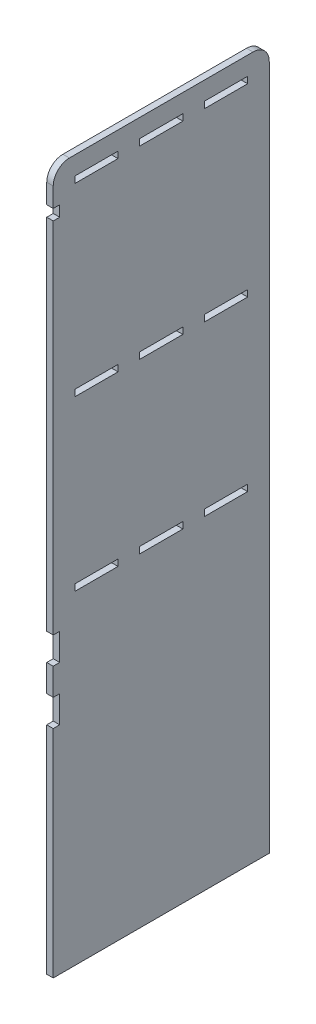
from build123d import *

# Parameters (mm, degrees)
CROQUIS2_W              = 80
CROQUIS2_H              = 12
SALIENTE_EXTRUIR1_DEPTH = 12


with BuildPart() as part:
    # Croquis2 → Saliente-Extruir1 (new body)
    with BuildSketch(Plane(origin=(0, 0, 0), x_dir=(0, 0, -1), z_dir=(1, 0, 0))):
        with BuildLine():
            Line((-200, -650), (200, -650))
            Line((200, -650), (200, 620))
            ThreePointArc((200, 620), (191.213203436, 641.213203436), (170, 650))
            Line((170, 650), (-170, 650))
            ThreePointArc((-170, 650), (-191.213203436, 641.213203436), (-200, 620))
            Line((-200, 620), (-200, 584))
            Line((-200, 584), (-188, 584))
            Line((-188, 584), (-188, 564))
            Line((-188, 564), (-200, 564))
            Line((-200, 564), (-200, -100))
            Line((-200, -100), (-188, -100))
            Line((-188, -100), (-188, -150))
            Line((-188, -150), (-200, -150))
            Line((-200, -150), (-200, -200))
            Line((-200, -200), (-188, -200))
            Line((-188, -200), (-188, -250))
            Line((-188, -250), (-200, -250))
            Line((-200, -250), (-200, -650))
        make_face()
        with Locations((0, -44)):
            Rectangle(CROQUIS2_W, CROQUIS2_H, mode=Mode.SUBTRACT)
        with Locations((-120, -44)):
            Rectangle(CROQUIS2_W, CROQUIS2_H, mode=Mode.SUBTRACT)
        with Locations((120, -44)):
            Rectangle(CROQUIS2_W, CROQUIS2_H, mode=Mode.SUBTRACT)
        with Locations((-120, 268)):
            Rectangle(CROQUIS2_W, CROQUIS2_H, mode=Mode.SUBTRACT)
        with Locations((0, 268)):
            Rectangle(CROQUIS2_W, CROQUIS2_H, mode=Mode.SUBTRACT)
        with Locations((120, 268)):
            Rectangle(CROQUIS2_W, CROQUIS2_H, mode=Mode.SUBTRACT)
        with Locations((120, 610)):
            Rectangle(CROQUIS2_W, CROQUIS2_H, mode=Mode.SUBTRACT)
        with Locations((0, 610)):
            Rectangle(CROQUIS2_W, CROQUIS2_H, mode=Mode.SUBTRACT)
        with Locations((-120, 610)):
            Rectangle(CROQUIS2_W, CROQUIS2_H, mode=Mode.SUBTRACT)
    extrude(amount=SALIENTE_EXTRUIR1_DEPTH)


solid = part.part
